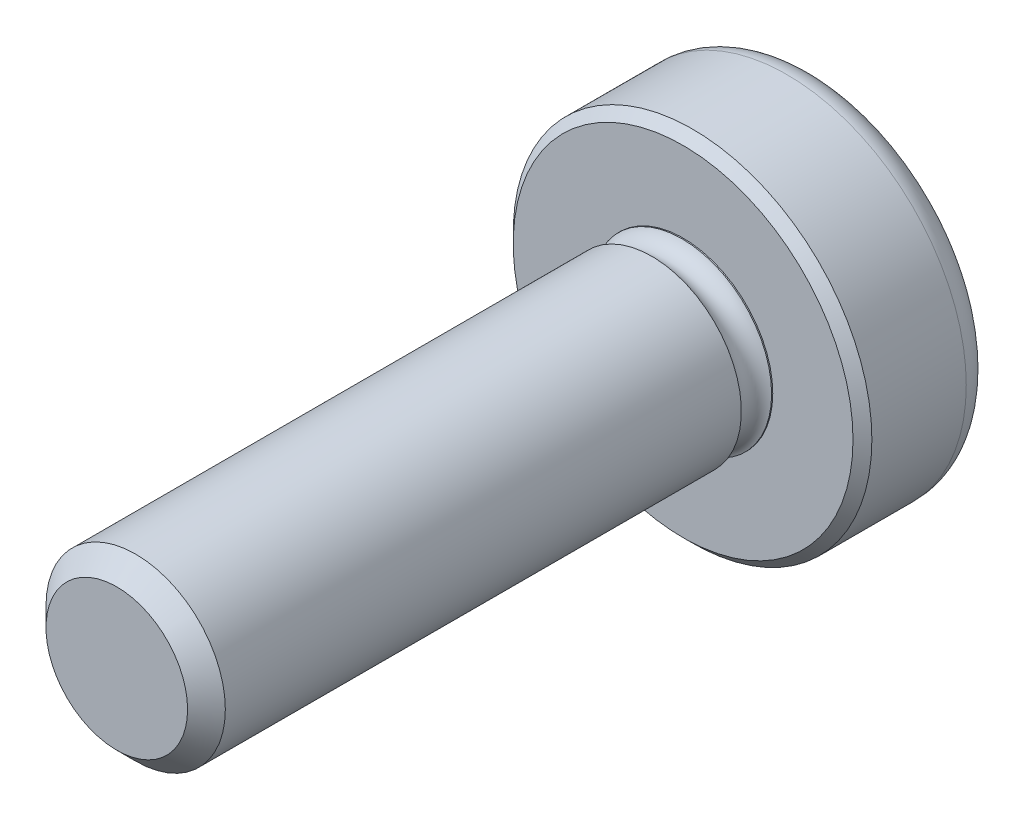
ISO-10303-21;
HEADER;
FILE_DESCRIPTION(('STEP AP214'),'2;1');
FILE_NAME('part.step','',(''),(''),'','','');
FILE_SCHEMA(('AUTOMOTIVE_DESIGN { 1 0 10303 214 1 1 1 1 }'));
ENDSEC;
DATA;
#1=APPLICATION_CONTEXT('core data for automotive mechanical design processes');
#2=APPLICATION_PROTOCOL_DEFINITION('international standard','automotive_design',2000,#1);
#3=PRODUCT_CONTEXT('',#1,'mechanical');
#4=PRODUCT('Part','Part','',(#3));
#5=PRODUCT_RELATED_PRODUCT_CATEGORY('part','',(#4));
#6=PRODUCT_DEFINITION_FORMATION('','',#4);
#7=PRODUCT_DEFINITION_CONTEXT('part definition',#1,'design');
#8=PRODUCT_DEFINITION('design','',#6,#7);
#9=PRODUCT_DEFINITION_SHAPE('','',#8);
#10=(LENGTH_UNIT() NAMED_UNIT(*) SI_UNIT(.MILLI.,.METRE.));
#11=(NAMED_UNIT(*) PLANE_ANGLE_UNIT() SI_UNIT($,.RADIAN.));
#12=(NAMED_UNIT(*) SI_UNIT($,.STERADIAN.) SOLID_ANGLE_UNIT());
#13=UNCERTAINTY_MEASURE_WITH_UNIT(LENGTH_MEASURE(1.E-05),#10,'distance_accuracy_value','');
#14=(GEOMETRIC_REPRESENTATION_CONTEXT(3) GLOBAL_UNCERTAINTY_ASSIGNED_CONTEXT((#13)) GLOBAL_UNIT_ASSIGNED_CONTEXT((#10,
#11,#12)) REPRESENTATION_CONTEXT('',''));
#15=CARTESIAN_POINT('',(0.,0.,0.));
#16=DIRECTION('',(0.,0.,1.));
#17=DIRECTION('',(1.,0.,0.));
#18=AXIS2_PLACEMENT_3D('',#15,#16,#17);
#19=CARTESIAN_POINT('',(0.,0.,7.4));
#20=DIRECTION('',(0.,0.,-1.));
#21=DIRECTION('',(-1.,0.,0.));
#22=AXIS2_PLACEMENT_3D('',#19,#20,#21);
#23=CYLINDRICAL_SURFACE('',#22,0.95);
#24=CARTESIAN_POINT('',(0.,0.,1.4));
#25=DIRECTION('',(0.,0.,1.));
#26=DIRECTION('',(1.,0.,0.));
#27=AXIS2_PLACEMENT_3D('',#24,#25,#26);
#28=CIRCLE('',#27,0.95);
#29=CARTESIAN_POINT('',(0.95,0.,1.4));
#30=VERTEX_POINT('',#29);
#31=EDGE_CURVE('E178',#30,#30,#28,.T.);
#32=ORIENTED_EDGE('',*,*,#31,.T.);
#33=EDGE_LOOP('',(#32));
#34=FACE_BOUND('',#33,.T.);
#35=CARTESIAN_POINT('',(0.,0.,1.41231411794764));
#36=DIRECTION('',(0.,0.,1.));
#37=DIRECTION('',(1.,0.,0.));
#38=AXIS2_PLACEMENT_3D('',#35,#36,#37);
#39=CIRCLE('',#38,0.95);
#40=CARTESIAN_POINT('',(0.95,0.,1.41231411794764));
#41=VERTEX_POINT('',#40);
#42=EDGE_CURVE('E36',#41,#41,#39,.T.);
#43=ORIENTED_EDGE('',*,*,#42,.F.);
#44=EDGE_LOOP('',(#43));
#45=FACE_BOUND('',#44,.T.);
#46=ADVANCED_FACE('F32',(#34,#45),#23,.T.);
#47=CARTESIAN_POINT('',(0.,0.,1.4));
#48=DIRECTION('',(0.,0.,1.));
#49=DIRECTION('',(1.,0.,0.));
#50=AXIS2_PLACEMENT_3D('',#47,#48,#49);
#51=PLANE('',#50);
#52=CARTESIAN_POINT('',(0.,0.,1.4));
#53=DIRECTION('',(0.,0.,1.));
#54=DIRECTION('',(1.,0.,0.));
#55=AXIS2_PLACEMENT_3D('',#52,#53,#54);
#56=CIRCLE('',#55,1.8);
#57=CARTESIAN_POINT('',(1.8,0.,1.4));
#58=VERTEX_POINT('',#57);
#59=EDGE_CURVE('E236',#58,#58,#56,.T.);
#60=ORIENTED_EDGE('',*,*,#59,.T.);
#61=EDGE_LOOP('',(#60));
#62=FACE_BOUND('',#61,.T.);
#63=ORIENTED_EDGE('',*,*,#31,.F.);
#64=EDGE_LOOP('',(#63));
#65=FACE_BOUND('',#64,.T.);
#66=ADVANCED_FACE('F253',(#62,#65),#51,.T.);
#67=CARTESIAN_POINT('',(0.,0.,1.4));
#68=DIRECTION('',(0.,0.,-1.));
#69=DIRECTION('',(-1.,0.,0.));
#70=AXIS2_PLACEMENT_3D('',#67,#68,#69);
#71=CYLINDRICAL_SURFACE('',#70,1.9);
#72=CARTESIAN_POINT('',(0.,0.,0.3));
#73=DIRECTION('',(0.,0.,1.));
#74=DIRECTION('',(1.,0.,0.));
#75=AXIS2_PLACEMENT_3D('',#72,#73,#74);
#76=CIRCLE('',#75,1.9);
#77=CARTESIAN_POINT('',(1.9,0.,0.3));
#78=VERTEX_POINT('',#77);
#79=EDGE_CURVE('E41',#78,#78,#76,.T.);
#80=ORIENTED_EDGE('',*,*,#79,.T.);
#81=EDGE_LOOP('',(#80));
#82=FACE_BOUND('',#81,.T.);
#83=CARTESIAN_POINT('',(0.,0.,1.3));
#84=DIRECTION('',(0.,0.,1.));
#85=DIRECTION('',(1.,0.,0.));
#86=AXIS2_PLACEMENT_3D('',#83,#84,#85);
#87=CIRCLE('',#86,1.9);
#88=CARTESIAN_POINT('',(1.9,0.,1.3));
#89=VERTEX_POINT('',#88);
#90=EDGE_CURVE('E239',#89,#89,#87,.F.);
#91=ORIENTED_EDGE('',*,*,#90,.T.);
#92=EDGE_LOOP('',(#91));
#93=FACE_BOUND('',#92,.T.);
#94=ADVANCED_FACE('F260',(#82,#93),#71,.T.);
#95=CARTESIAN_POINT('',(0.,0.,0.));
#96=DIRECTION('',(0.,0.,1.));
#97=DIRECTION('',(1.,0.,0.));
#98=AXIS2_PLACEMENT_3D('',#95,#96,#97);
#99=PLANE('',#98);
#100=DIRECTION('',(1.,0.,0.));
#101=VECTOR('',#100,1.);
#102=CARTESIAN_POINT('',(0.247182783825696,0.264203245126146,0.));
#103=LINE('',#102,#101);
#104=CARTESIAN_POINT('',(0.247182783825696,0.264203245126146,0.));
#105=VERTEX_POINT('',#104);
#106=CARTESIAN_POINT('',(1.37075217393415,0.264203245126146,0.));
#107=VERTEX_POINT('',#106);
#108=EDGE_CURVE('E141',#105,#107,#103,.T.);
#109=ORIENTED_EDGE('',*,*,#108,.F.);
#110=DIRECTION('',(0.,-1.,0.));
#111=VECTOR('',#110,1.);
#112=CARTESIAN_POINT('',(0.247182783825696,1.37166336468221,0.));
#113=LINE('',#112,#111);
#114=CARTESIAN_POINT('',(0.247182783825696,1.37166336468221,0.));
#115=VERTEX_POINT('',#114);
#116=EDGE_CURVE('E49',#115,#105,#113,.T.);
#117=ORIENTED_EDGE('',*,*,#116,.F.);
#118=DIRECTION('',(1.,0.,0.));
#119=VECTOR('',#118,1.);
#120=CARTESIAN_POINT('',(0.247182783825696,1.37166336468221,0.));
#121=LINE('',#120,#119);
#122=CARTESIAN_POINT('',(-0.247182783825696,1.37166336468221,0.));
#123=VERTEX_POINT('',#122);
#124=EDGE_CURVE('E174',#123,#115,#121,.T.);
#125=ORIENTED_EDGE('',*,*,#124,.F.);
#126=DIRECTION('',(0.,1.,0.));
#127=VECTOR('',#126,1.);
#128=CARTESIAN_POINT('',(-0.247182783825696,1.37166336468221,0.));
#129=LINE('',#128,#127);
#130=CARTESIAN_POINT('',(-0.247182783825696,0.264203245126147,0.));
#131=VERTEX_POINT('',#130);
#132=EDGE_CURVE('E172',#131,#123,#129,.T.);
#133=ORIENTED_EDGE('',*,*,#132,.F.);
#134=DIRECTION('',(1.,0.,0.));
#135=VECTOR('',#134,1.);
#136=CARTESIAN_POINT('',(-1.36706987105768,0.264203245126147,0.));
#137=LINE('',#136,#135);
#138=CARTESIAN_POINT('',(-1.36706987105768,0.264203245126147,0.));
#139=VERTEX_POINT('',#138);
#140=EDGE_CURVE('E169',#139,#131,#137,.T.);
#141=ORIENTED_EDGE('',*,*,#140,.F.);
#142=DIRECTION('',(0.,1.,0.));
#143=VECTOR('',#142,1.);
#144=CARTESIAN_POINT('',(-1.36706987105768,0.264203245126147,0.));
#145=LINE('',#144,#143);
#146=CARTESIAN_POINT('',(-1.36706987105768,-0.264203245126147,0.));
#147=VERTEX_POINT('',#146);
#148=EDGE_CURVE('E166',#147,#139,#145,.T.);
#149=ORIENTED_EDGE('',*,*,#148,.F.);
#150=DIRECTION('',(-1.,0.,0.));
#151=VECTOR('',#150,1.);
#152=CARTESIAN_POINT('',(-1.36706987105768,-0.264203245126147,0.));
#153=LINE('',#152,#151);
#154=CARTESIAN_POINT('',(-0.247182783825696,-0.264203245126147,0.));
#155=VERTEX_POINT('',#154);
#156=EDGE_CURVE('E163',#155,#147,#153,.T.);
#157=ORIENTED_EDGE('',*,*,#156,.F.);
#158=DIRECTION('',(0.,1.,0.));
#159=VECTOR('',#158,1.);
#160=CARTESIAN_POINT('',(-0.247182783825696,-0.264203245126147,0.));
#161=LINE('',#160,#159);
#162=CARTESIAN_POINT('',(-0.247182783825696,-1.37307236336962,0.));
#163=VERTEX_POINT('',#162);
#164=EDGE_CURVE('E160',#163,#155,#161,.T.);
#165=ORIENTED_EDGE('',*,*,#164,.F.);
#166=DIRECTION('',(-1.,0.,0.));
#167=VECTOR('',#166,1.);
#168=CARTESIAN_POINT('',(0.247182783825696,-1.37307236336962,0.));
#169=LINE('',#168,#167);
#170=CARTESIAN_POINT('',(0.247182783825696,-1.37307236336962,0.));
#171=VERTEX_POINT('',#170);
#172=EDGE_CURVE('E157',#171,#163,#169,.T.);
#173=ORIENTED_EDGE('',*,*,#172,.F.);
#174=DIRECTION('',(0.,-1.,0.));
#175=VECTOR('',#174,1.);
#176=CARTESIAN_POINT('',(0.247182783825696,-0.264203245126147,0.));
#177=LINE('',#176,#175);
#178=CARTESIAN_POINT('',(0.247182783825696,-0.264203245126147,0.));
#179=VERTEX_POINT('',#178);
#180=EDGE_CURVE('E151',#179,#171,#177,.T.);
#181=ORIENTED_EDGE('',*,*,#180,.F.);
#182=DIRECTION('',(-1.,0.,0.));
#183=VECTOR('',#182,1.);
#184=CARTESIAN_POINT('',(0.247182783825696,-0.264203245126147,0.));
#185=LINE('',#184,#183);
#186=CARTESIAN_POINT('',(1.37075217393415,-0.264203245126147,0.));
#187=VERTEX_POINT('',#186);
#188=EDGE_CURVE('E149',#187,#179,#185,.T.);
#189=ORIENTED_EDGE('',*,*,#188,.F.);
#190=DIRECTION('',(0.,-1.,0.));
#191=VECTOR('',#190,1.);
#192=CARTESIAN_POINT('',(1.37075217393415,0.264203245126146,0.));
#193=LINE('',#192,#191);
#194=EDGE_CURVE('E132',#107,#187,#193,.T.);
#195=ORIENTED_EDGE('',*,*,#194,.F.);
#196=EDGE_LOOP('',(#109,#117,#125,#133,#141,#149,#157,#165,#173,#181,#189,#195));
#197=FACE_BOUND('',#196,.T.);
#198=CARTESIAN_POINT('',(0.,0.,0.));
#199=DIRECTION('',(0.,0.,1.));
#200=DIRECTION('',(1.,0.,0.));
#201=AXIS2_PLACEMENT_3D('',#198,#199,#200);
#202=CIRCLE('',#201,1.6);
#203=CARTESIAN_POINT('',(1.6,0.,0.));
#204=VERTEX_POINT('',#203);
#205=EDGE_CURVE('E11',#204,#204,#202,.F.);
#206=ORIENTED_EDGE('',*,*,#205,.T.);
#207=EDGE_LOOP('',(#206));
#208=FACE_BOUND('',#207,.T.);
#209=ADVANCED_FACE('F145',(#197,#208),#99,.F.);
#210=CARTESIAN_POINT('',(0.,0.,1.4));
#211=DIRECTION('',(0.,0.,-1.));
#212=DIRECTION('',(-1.,0.,0.));
#213=AXIS2_PLACEMENT_3D('',#210,#211,#212);
#214=CONICAL_SURFACE('',#213,1.8,0.785398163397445);
#215=ORIENTED_EDGE('',*,*,#90,.F.);
#216=EDGE_LOOP('',(#215));
#217=FACE_BOUND('',#216,.T.);
#218=ORIENTED_EDGE('',*,*,#59,.F.);
#219=EDGE_LOOP('',(#218));
#220=FACE_BOUND('',#219,.T.);
#221=ADVANCED_FACE('F432',(#217,#220),#214,.T.);
#222=CARTESIAN_POINT('',(0.,0.,0.3));
#223=DIRECTION('',(0.,0.,1.));
#224=DIRECTION('',(1.,0.,0.));
#225=AXIS2_PLACEMENT_3D('',#222,#223,#224);
#226=TOROIDAL_SURFACE('',#225,1.6,0.3);
#227=ORIENTED_EDGE('',*,*,#205,.F.);
#228=EDGE_LOOP('',(#227));
#229=FACE_BOUND('',#228,.T.);
#230=ORIENTED_EDGE('',*,*,#79,.F.);
#231=EDGE_LOOP('',(#230));
#232=FACE_BOUND('',#231,.T.);
#233=ADVANCED_FACE('F34',(#229,#232),#226,.T.);
#234=CARTESIAN_POINT('',(0.247182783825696,1.37166336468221,0.));
#235=DIRECTION('',(0.984807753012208,0.,0.173648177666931));
#236=DIRECTION('',(0.173648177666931,0.,-0.984807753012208));
#237=AXIS2_PLACEMENT_3D('',#234,#235,#236);
#238=PLANE('',#237);
#239=ORIENTED_EDGE('',*,*,#116,.T.);
#240=DIRECTION('',(0.171087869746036,0.171087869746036,-0.970287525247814));
#241=VECTOR('',#240,1.);
#242=CARTESIAN_POINT('',(0.247182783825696,0.264203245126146,0.));
#243=LINE('',#242,#241);
#244=CARTESIAN_POINT('',(0.159019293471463,0.176039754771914,0.5));
#245=VERTEX_POINT('',#244);
#246=EDGE_CURVE('E92',#245,#105,#243,.T.);
#247=ORIENTED_EDGE('',*,*,#246,.F.);
#248=DIRECTION('',(0.,-1.,0.));
#249=VECTOR('',#248,1.);
#250=CARTESIAN_POINT('',(0.159019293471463,1.37166336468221,0.5));
#251=LINE('',#250,#249);
#252=CARTESIAN_POINT('',(0.159019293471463,1.28349987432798,0.5));
#253=VERTEX_POINT('',#252);
#254=EDGE_CURVE('E176',#253,#245,#251,.T.);
#255=ORIENTED_EDGE('',*,*,#254,.F.);
#256=DIRECTION('',(0.171087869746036,0.171087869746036,-0.970287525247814));
#257=VECTOR('',#256,1.);
#258=CARTESIAN_POINT('',(0.247182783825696,1.37166336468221,0.));
#259=LINE('',#258,#257);
#260=EDGE_CURVE('E57',#253,#115,#259,.T.);
#261=ORIENTED_EDGE('',*,*,#260,.T.);
#262=EDGE_LOOP('',(#239,#247,#255,#261));
#263=FACE_BOUND('',#262,.T.);
#264=ADVANCED_FACE('F289',(#263),#238,.F.);
#265=CARTESIAN_POINT('',(0.247182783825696,1.37166336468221,0.));
#266=DIRECTION('',(0.,0.984807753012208,0.173648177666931));
#267=DIRECTION('',(0.,-0.173648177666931,0.984807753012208));
#268=AXIS2_PLACEMENT_3D('',#265,#266,#267);
#269=PLANE('',#268);
#270=ORIENTED_EDGE('',*,*,#124,.T.);
#271=ORIENTED_EDGE('',*,*,#260,.F.);
#272=DIRECTION('',(1.,0.,0.));
#273=VECTOR('',#272,1.);
#274=CARTESIAN_POINT('',(0.247182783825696,1.28349987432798,0.5));
#275=LINE('',#274,#273);
#276=CARTESIAN_POINT('',(-0.159019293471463,1.28349987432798,0.5));
#277=VERTEX_POINT('',#276);
#278=EDGE_CURVE('E179',#277,#253,#275,.T.);
#279=ORIENTED_EDGE('',*,*,#278,.F.);
#280=DIRECTION('',(-0.171087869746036,0.171087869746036,-0.970287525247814));
#281=VECTOR('',#280,1.);
#282=CARTESIAN_POINT('',(-0.247182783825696,1.37166336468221,0.));
#283=LINE('',#282,#281);
#284=EDGE_CURVE('E97',#277,#123,#283,.T.);
#285=ORIENTED_EDGE('',*,*,#284,.T.);
#286=EDGE_LOOP('',(#270,#271,#279,#285));
#287=FACE_BOUND('',#286,.T.);
#288=ADVANCED_FACE('F285',(#287),#269,.F.);
#289=CARTESIAN_POINT('',(-0.247182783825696,1.37166336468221,0.));
#290=DIRECTION('',(-0.984807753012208,0.,0.173648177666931));
#291=DIRECTION('',(0.173648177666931,0.,0.984807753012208));
#292=AXIS2_PLACEMENT_3D('',#289,#290,#291);
#293=PLANE('',#292);
#294=ORIENTED_EDGE('',*,*,#132,.T.);
#295=ORIENTED_EDGE('',*,*,#284,.F.);
#296=DIRECTION('',(0.,1.,0.));
#297=VECTOR('',#296,1.);
#298=CARTESIAN_POINT('',(-0.159019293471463,1.37166336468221,0.5));
#299=LINE('',#298,#297);
#300=CARTESIAN_POINT('',(-0.159019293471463,0.176039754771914,0.5));
#301=VERTEX_POINT('',#300);
#302=EDGE_CURVE('E202',#301,#277,#299,.T.);
#303=ORIENTED_EDGE('',*,*,#302,.F.);
#304=DIRECTION('',(-0.171087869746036,0.171087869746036,-0.970287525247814));
#305=VECTOR('',#304,1.);
#306=CARTESIAN_POINT('',(-0.279599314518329,0.296619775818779,-0.183843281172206));
#307=LINE('',#306,#305);
#308=EDGE_CURVE('E194',#301,#131,#307,.T.);
#309=ORIENTED_EDGE('',*,*,#308,.T.);
#310=EDGE_LOOP('',(#294,#295,#303,#309));
#311=FACE_BOUND('',#310,.T.);
#312=ADVANCED_FACE('F288',(#311),#293,.F.);
#313=CARTESIAN_POINT('',(-1.36706987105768,0.264203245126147,0.));
#314=DIRECTION('',(0.,0.984807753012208,0.173648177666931));
#315=DIRECTION('',(0.,-0.173648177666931,0.984807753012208));
#316=AXIS2_PLACEMENT_3D('',#313,#314,#315);
#317=PLANE('',#316);
#318=ORIENTED_EDGE('',*,*,#140,.T.);
#319=ORIENTED_EDGE('',*,*,#308,.F.);
#320=DIRECTION('',(1.,0.,0.));
#321=VECTOR('',#320,1.);
#322=CARTESIAN_POINT('',(-1.36706987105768,0.176039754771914,0.5));
#323=LINE('',#322,#321);
#324=CARTESIAN_POINT('',(-1.27890638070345,0.176039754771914,0.5));
#325=VERTEX_POINT('',#324);
#326=EDGE_CURVE('E205',#325,#301,#323,.T.);
#327=ORIENTED_EDGE('',*,*,#326,.F.);
#328=DIRECTION('',(-0.171087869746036,0.171087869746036,-0.970287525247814));
#329=VECTOR('',#328,1.);
#330=CARTESIAN_POINT('',(-1.36706987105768,0.264203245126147,0.));
#331=LINE('',#330,#329);
#332=EDGE_CURVE('E192',#325,#139,#331,.T.);
#333=ORIENTED_EDGE('',*,*,#332,.T.);
#334=EDGE_LOOP('',(#318,#319,#327,#333));
#335=FACE_BOUND('',#334,.T.);
#336=ADVANCED_FACE('F292',(#335),#317,.F.);
#337=CARTESIAN_POINT('',(-1.36706987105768,0.264203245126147,0.));
#338=DIRECTION('',(-0.984807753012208,0.,0.173648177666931));
#339=DIRECTION('',(0.173648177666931,0.,0.984807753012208));
#340=AXIS2_PLACEMENT_3D('',#337,#338,#339);
#341=PLANE('',#340);
#342=ORIENTED_EDGE('',*,*,#148,.T.);
#343=ORIENTED_EDGE('',*,*,#332,.F.);
#344=DIRECTION('',(0.,1.,0.));
#345=VECTOR('',#344,1.);
#346=CARTESIAN_POINT('',(-1.27890638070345,0.264203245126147,0.5));
#347=LINE('',#346,#345);
#348=CARTESIAN_POINT('',(-1.27890638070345,-0.176039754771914,0.5));
#349=VERTEX_POINT('',#348);
#350=EDGE_CURVE('E208',#349,#325,#347,.T.);
#351=ORIENTED_EDGE('',*,*,#350,.F.);
#352=DIRECTION('',(-0.171087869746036,-0.171087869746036,-0.970287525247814));
#353=VECTOR('',#352,1.);
#354=CARTESIAN_POINT('',(-1.36706987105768,-0.264203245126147,0.));
#355=LINE('',#354,#353);
#356=EDGE_CURVE('E190',#349,#147,#355,.T.);
#357=ORIENTED_EDGE('',*,*,#356,.T.);
#358=EDGE_LOOP('',(#342,#343,#351,#357));
#359=FACE_BOUND('',#358,.T.);
#360=ADVANCED_FACE('F296',(#359),#341,.F.);
#361=CARTESIAN_POINT('',(-1.36706987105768,-0.264203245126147,0.));
#362=DIRECTION('',(0.,-0.984807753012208,0.173648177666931));
#363=DIRECTION('',(0.,-0.173648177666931,-0.984807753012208));
#364=AXIS2_PLACEMENT_3D('',#361,#362,#363);
#365=PLANE('',#364);
#366=ORIENTED_EDGE('',*,*,#156,.T.);
#367=ORIENTED_EDGE('',*,*,#356,.F.);
#368=DIRECTION('',(-1.,0.,0.));
#369=VECTOR('',#368,1.);
#370=CARTESIAN_POINT('',(-1.36706987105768,-0.176039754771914,0.5));
#371=LINE('',#370,#369);
#372=CARTESIAN_POINT('',(-0.159019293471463,-0.176039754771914,0.5));
#373=VERTEX_POINT('',#372);
#374=EDGE_CURVE('E211',#373,#349,#371,.T.);
#375=ORIENTED_EDGE('',*,*,#374,.F.);
#376=DIRECTION('',(-0.171087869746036,-0.171087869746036,-0.970287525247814));
#377=VECTOR('',#376,1.);
#378=CARTESIAN_POINT('',(-0.279963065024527,-0.296983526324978,-0.185906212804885));
#379=LINE('',#378,#377);
#380=EDGE_CURVE('E188',#373,#155,#379,.T.);
#381=ORIENTED_EDGE('',*,*,#380,.T.);
#382=EDGE_LOOP('',(#366,#367,#375,#381));
#383=FACE_BOUND('',#382,.T.);
#384=ADVANCED_FACE('F300',(#383),#365,.F.);
#385=CARTESIAN_POINT('',(-0.247182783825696,-0.264203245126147,0.));
#386=DIRECTION('',(-0.984807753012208,0.,0.173648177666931));
#387=DIRECTION('',(0.173648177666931,0.,0.984807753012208));
#388=AXIS2_PLACEMENT_3D('',#385,#386,#387);
#389=PLANE('',#388);
#390=ORIENTED_EDGE('',*,*,#164,.T.);
#391=ORIENTED_EDGE('',*,*,#380,.F.);
#392=DIRECTION('',(0.,1.,0.));
#393=VECTOR('',#392,1.);
#394=CARTESIAN_POINT('',(-0.159019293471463,-0.264203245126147,0.5));
#395=LINE('',#394,#393);
#396=CARTESIAN_POINT('',(-0.159019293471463,-1.28490887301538,0.5));
#397=VERTEX_POINT('',#396);
#398=EDGE_CURVE('E214',#397,#373,#395,.T.);
#399=ORIENTED_EDGE('',*,*,#398,.F.);
#400=DIRECTION('',(-0.171087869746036,-0.171087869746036,-0.970287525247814));
#401=VECTOR('',#400,1.);
#402=CARTESIAN_POINT('',(-0.232712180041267,-1.35860175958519,0.0820668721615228));
#403=LINE('',#402,#401);
#404=EDGE_CURVE('E186',#397,#163,#403,.T.);
#405=ORIENTED_EDGE('',*,*,#404,.T.);
#406=EDGE_LOOP('',(#390,#391,#399,#405));
#407=FACE_BOUND('',#406,.T.);
#408=ADVANCED_FACE('F304',(#407),#389,.F.);
#409=CARTESIAN_POINT('',(0.247182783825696,-1.37307236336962,0.));
#410=DIRECTION('',(0.,-0.984807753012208,0.173648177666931));
#411=DIRECTION('',(0.,-0.173648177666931,-0.984807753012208));
#412=AXIS2_PLACEMENT_3D('',#409,#410,#411);
#413=PLANE('',#412);
#414=ORIENTED_EDGE('',*,*,#172,.T.);
#415=ORIENTED_EDGE('',*,*,#404,.F.);
#416=DIRECTION('',(-1.,0.,0.));
#417=VECTOR('',#416,1.);
#418=CARTESIAN_POINT('',(0.247182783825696,-1.28490887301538,0.5));
#419=LINE('',#418,#417);
#420=CARTESIAN_POINT('',(0.159019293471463,-1.28490887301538,0.5));
#421=VERTEX_POINT('',#420);
#422=EDGE_CURVE('E217',#421,#397,#419,.T.);
#423=ORIENTED_EDGE('',*,*,#422,.F.);
#424=DIRECTION('',(0.171087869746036,-0.171087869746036,-0.970287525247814));
#425=VECTOR('',#424,1.);
#426=CARTESIAN_POINT('',(0.214725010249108,-1.34061458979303,0.184077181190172));
#427=LINE('',#426,#425);
#428=EDGE_CURVE('E184',#421,#171,#427,.T.);
#429=ORIENTED_EDGE('',*,*,#428,.T.);
#430=EDGE_LOOP('',(#414,#415,#423,#429));
#431=FACE_BOUND('',#430,.T.);
#432=ADVANCED_FACE('F308',(#431),#413,.F.);
#433=CARTESIAN_POINT('',(0.247182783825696,-0.264203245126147,0.));
#434=DIRECTION('',(0.984807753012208,0.,0.173648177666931));
#435=DIRECTION('',(0.173648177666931,0.,-0.984807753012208));
#436=AXIS2_PLACEMENT_3D('',#433,#434,#435);
#437=PLANE('',#436);
#438=ORIENTED_EDGE('',*,*,#180,.T.);
#439=ORIENTED_EDGE('',*,*,#428,.F.);
#440=DIRECTION('',(0.,-1.,0.));
#441=VECTOR('',#440,1.);
#442=CARTESIAN_POINT('',(0.159019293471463,-0.264203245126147,0.5));
#443=LINE('',#442,#441);
#444=CARTESIAN_POINT('',(0.159019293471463,-0.176039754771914,0.5));
#445=VERTEX_POINT('',#444);
#446=EDGE_CURVE('E220',#445,#421,#443,.T.);
#447=ORIENTED_EDGE('',*,*,#446,.F.);
#448=DIRECTION('',(0.171087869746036,-0.171087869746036,-0.970287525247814));
#449=VECTOR('',#448,1.);
#450=CARTESIAN_POINT('',(0.247182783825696,-0.264203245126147,0.));
#451=LINE('',#450,#449);
#452=EDGE_CURVE('E182',#445,#179,#451,.T.);
#453=ORIENTED_EDGE('',*,*,#452,.T.);
#454=EDGE_LOOP('',(#438,#439,#447,#453));
#455=FACE_BOUND('',#454,.T.);
#456=ADVANCED_FACE('F312',(#455),#437,.F.);
#457=CARTESIAN_POINT('',(0.247182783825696,-0.264203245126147,0.));
#458=DIRECTION('',(0.,-0.984807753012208,0.173648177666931));
#459=DIRECTION('',(0.,-0.173648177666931,-0.984807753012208));
#460=AXIS2_PLACEMENT_3D('',#457,#458,#459);
#461=PLANE('',#460);
#462=ORIENTED_EDGE('',*,*,#188,.T.);
#463=ORIENTED_EDGE('',*,*,#452,.F.);
#464=DIRECTION('',(-1.,0.,0.));
#465=VECTOR('',#464,1.);
#466=CARTESIAN_POINT('',(0.247182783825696,-0.176039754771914,0.5));
#467=LINE('',#466,#465);
#468=CARTESIAN_POINT('',(1.28258868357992,-0.176039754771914,0.5));
#469=VERTEX_POINT('',#468);
#470=EDGE_CURVE('E223',#469,#445,#467,.T.);
#471=ORIENTED_EDGE('',*,*,#470,.F.);
#472=DIRECTION('',(0.171087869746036,-0.171087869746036,-0.970287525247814));
#473=VECTOR('',#472,1.);
#474=CARTESIAN_POINT('',(1.35528515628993,-0.248736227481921,0.0877178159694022));
#475=LINE('',#474,#473);
#476=EDGE_CURVE('E138',#469,#187,#475,.T.);
#477=ORIENTED_EDGE('',*,*,#476,.T.);
#478=EDGE_LOOP('',(#462,#463,#471,#477));
#479=FACE_BOUND('',#478,.T.);
#480=ADVANCED_FACE('F316',(#479),#461,.F.);
#481=CARTESIAN_POINT('',(1.37075217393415,0.264203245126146,0.));
#482=DIRECTION('',(0.984807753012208,0.,0.173648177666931));
#483=DIRECTION('',(0.173648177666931,0.,-0.984807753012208));
#484=AXIS2_PLACEMENT_3D('',#481,#482,#483);
#485=PLANE('',#484);
#486=ORIENTED_EDGE('',*,*,#194,.T.);
#487=ORIENTED_EDGE('',*,*,#476,.F.);
#488=DIRECTION('',(0.,-1.,0.));
#489=VECTOR('',#488,1.);
#490=CARTESIAN_POINT('',(1.28258868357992,0.264203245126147,0.5));
#491=LINE('',#490,#489);
#492=CARTESIAN_POINT('',(1.28258868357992,0.176039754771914,0.5));
#493=VERTEX_POINT('',#492);
#494=EDGE_CURVE('E135',#493,#469,#491,.T.);
#495=ORIENTED_EDGE('',*,*,#494,.F.);
#496=DIRECTION('',(0.171087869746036,0.171087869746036,-0.970287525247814));
#497=VECTOR('',#496,1.);
#498=CARTESIAN_POINT('',(1.33786410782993,0.231315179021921,0.186517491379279));
#499=LINE('',#498,#497);
#500=EDGE_CURVE('E128',#493,#107,#499,.T.);
#501=ORIENTED_EDGE('',*,*,#500,.T.);
#502=EDGE_LOOP('',(#486,#487,#495,#501));
#503=FACE_BOUND('',#502,.T.);
#504=ADVANCED_FACE('F130',(#503),#485,.F.);
#505=CARTESIAN_POINT('',(0.247182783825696,0.264203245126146,0.));
#506=DIRECTION('',(0.,0.984807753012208,0.173648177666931));
#507=DIRECTION('',(0.,-0.173648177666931,0.984807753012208));
#508=AXIS2_PLACEMENT_3D('',#505,#506,#507);
#509=PLANE('',#508);
#510=ORIENTED_EDGE('',*,*,#108,.T.);
#511=ORIENTED_EDGE('',*,*,#500,.F.);
#512=DIRECTION('',(1.,0.,0.));
#513=VECTOR('',#512,1.);
#514=CARTESIAN_POINT('',(0.247182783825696,0.176039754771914,0.5));
#515=LINE('',#514,#513);
#516=EDGE_CURVE('E199',#245,#493,#515,.T.);
#517=ORIENTED_EDGE('',*,*,#516,.F.);
#518=ORIENTED_EDGE('',*,*,#246,.T.);
#519=EDGE_LOOP('',(#510,#511,#517,#518));
#520=FACE_BOUND('',#519,.T.);
#521=ADVANCED_FACE('F142',(#520),#509,.F.);
#522=CARTESIAN_POINT('',(0.247182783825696,0.264203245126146,0.5));
#523=DIRECTION('',(0.,0.,1.));
#524=DIRECTION('',(1.,0.,0.));
#525=AXIS2_PLACEMENT_3D('',#522,#523,#524);
#526=PLANE('',#525);
#527=ORIENTED_EDGE('',*,*,#254,.T.);
#528=ORIENTED_EDGE('',*,*,#516,.T.);
#529=ORIENTED_EDGE('',*,*,#494,.T.);
#530=ORIENTED_EDGE('',*,*,#470,.T.);
#531=ORIENTED_EDGE('',*,*,#446,.T.);
#532=ORIENTED_EDGE('',*,*,#422,.T.);
#533=ORIENTED_EDGE('',*,*,#398,.T.);
#534=ORIENTED_EDGE('',*,*,#374,.T.);
#535=ORIENTED_EDGE('',*,*,#350,.T.);
#536=ORIENTED_EDGE('',*,*,#326,.T.);
#537=ORIENTED_EDGE('',*,*,#302,.T.);
#538=ORIENTED_EDGE('',*,*,#278,.T.);
#539=EDGE_LOOP('',(#527,#528,#529,#530,#531,#532,#533,#534,#535,#536,#537,#538));
#540=FACE_BOUND('',#539,.T.);
#541=ADVANCED_FACE('F282',(#540),#526,.F.);
#542=CARTESIAN_POINT('',(0.,0.,1.57260017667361));
#543=DIRECTION('',(0.,0.,-1.));
#544=DIRECTION('',(-1.,0.,0.));
#545=AXIS2_PLACEMENT_3D('',#542,#543,#544);
#546=TOROIDAL_SURFACE('',#545,1.01294544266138,0.172202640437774);
#547=CARTESIAN_POINT('',(0.,0.,1.73288623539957));
#548=DIRECTION('',(0.,0.,-1.));
#549=DIRECTION('',(-1.,0.,0.));
#550=AXIS2_PLACEMENT_3D('',#547,#548,#549);
#551=CIRCLE('',#550,0.95);
#552=CARTESIAN_POINT('',(-0.95,0.,1.73288623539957));
#553=VERTEX_POINT('',#552);
#554=EDGE_CURVE('E243',#553,#553,#551,.T.);
#555=ORIENTED_EDGE('',*,*,#554,.T.);
#556=EDGE_LOOP('',(#555));
#557=FACE_BOUND('',#556,.T.);
#558=ORIENTED_EDGE('',*,*,#42,.T.);
#559=EDGE_LOOP('',(#558));
#560=FACE_BOUND('',#559,.T.);
#561=ADVANCED_FACE('F250',(#557,#560),#546,.F.);
#562=CARTESIAN_POINT('',(0.,0.,7.4));
#563=DIRECTION('',(0.,0.,1.));
#564=DIRECTION('',(1.,0.,0.));
#565=AXIS2_PLACEMENT_3D('',#562,#563,#564);
#566=PLANE('',#565);
#567=CARTESIAN_POINT('',(0.,0.,7.4));
#568=DIRECTION('',(0.,0.,1.));
#569=DIRECTION('',(1.,0.,0.));
#570=AXIS2_PLACEMENT_3D('',#567,#568,#569);
#571=CIRCLE('',#570,0.75);
#572=CARTESIAN_POINT('',(0.75,0.,7.4));
#573=VERTEX_POINT('',#572);
#574=EDGE_CURVE('E230',#573,#573,#571,.T.);
#575=ORIENTED_EDGE('',*,*,#574,.T.);
#576=EDGE_LOOP('',(#575));
#577=FACE_BOUND('',#576,.T.);
#578=ADVANCED_FACE('F270',(#577),#566,.T.);
#579=CARTESIAN_POINT('',(0.,0.,7.4));
#580=DIRECTION('',(0.,0.,-1.));
#581=DIRECTION('',(-1.,0.,0.));
#582=AXIS2_PLACEMENT_3D('',#579,#580,#581);
#583=CONICAL_SURFACE('',#582,0.75,0.785398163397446);
#584=CARTESIAN_POINT('',(0.,0.,7.2));
#585=DIRECTION('',(0.,0.,1.));
#586=DIRECTION('',(1.,0.,0.));
#587=AXIS2_PLACEMENT_3D('',#584,#585,#586);
#588=CIRCLE('',#587,0.95);
#589=CARTESIAN_POINT('',(0.95,0.,7.2));
#590=VERTEX_POINT('',#589);
#591=EDGE_CURVE('E233',#590,#590,#588,.F.);
#592=ORIENTED_EDGE('',*,*,#591,.F.);
#593=EDGE_LOOP('',(#592));
#594=FACE_BOUND('',#593,.T.);
#595=ORIENTED_EDGE('',*,*,#574,.F.);
#596=EDGE_LOOP('',(#595));
#597=FACE_BOUND('',#596,.T.);
#598=ADVANCED_FACE('F265',(#594,#597),#583,.T.);
#599=ORIENTED_EDGE('',*,*,#591,.T.);
#600=EDGE_LOOP('',(#599));
#601=FACE_BOUND('',#600,.T.);
#602=ORIENTED_EDGE('',*,*,#554,.F.);
#603=EDGE_LOOP('',(#602));
#604=FACE_BOUND('',#603,.T.);
#605=ADVANCED_FACE('F256',(#601,#604),#23,.T.);
#606=CLOSED_SHELL('',(#46,#66,#94,#209,#221,#233,#264,#288,#312,#336,#360,#384,#408,#432,#456,
#480,#504,#521,#541,#561,#578,#598,#605));
#607=MANIFOLD_SOLID_BREP('B2',#606);
#608=ADVANCED_BREP_SHAPE_REPRESENTATION('',(#18,#607),#14);
#609=SHAPE_DEFINITION_REPRESENTATION(#9,#608);
ENDSEC;
END-ISO-10303-21;
